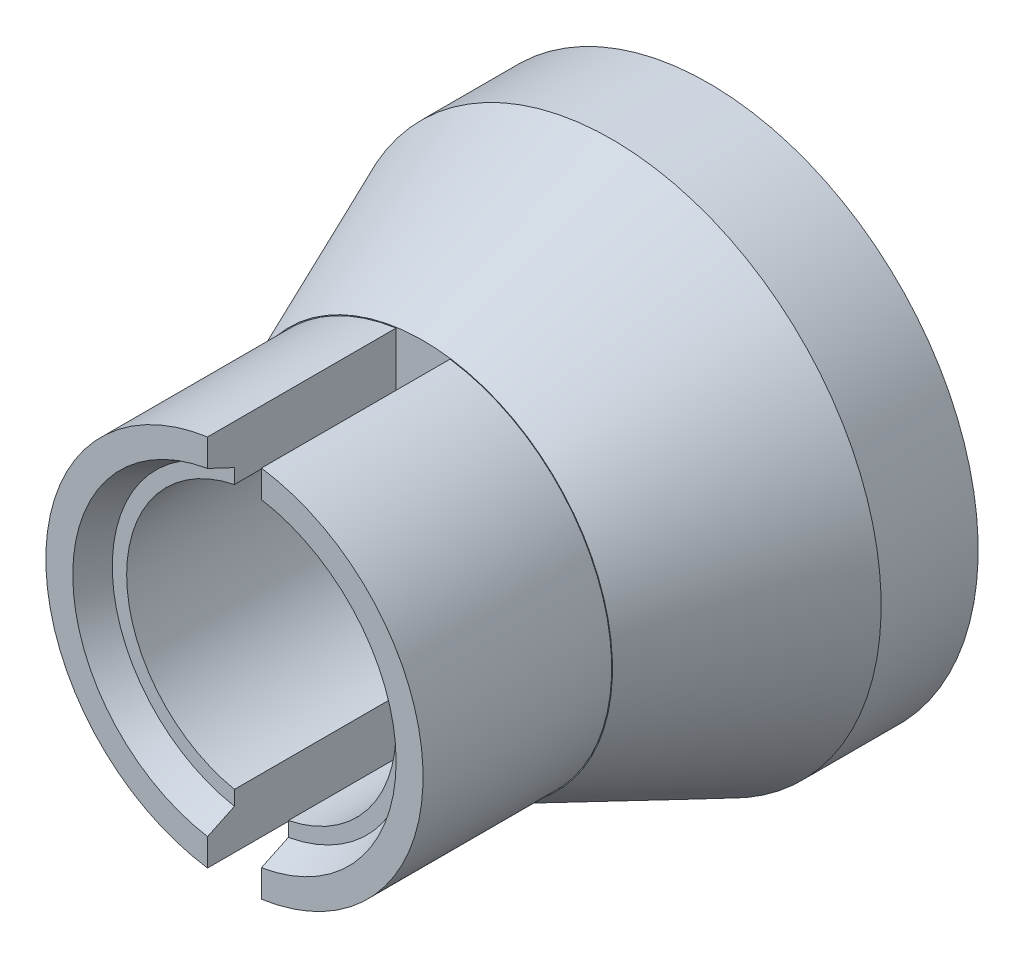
ISO-10303-21;
HEADER;
FILE_DESCRIPTION(('STEP AP214'),'2;1');
FILE_NAME('part.step','',(''),(''),'','','');
FILE_SCHEMA(('AUTOMOTIVE_DESIGN { 1 0 10303 214 1 1 1 1 }'));
ENDSEC;
DATA;
#1=APPLICATION_CONTEXT('core data for automotive mechanical design processes');
#2=APPLICATION_PROTOCOL_DEFINITION('international standard','automotive_design',2000,#1);
#3=PRODUCT_CONTEXT('',#1,'mechanical');
#4=PRODUCT('Part','Part','',(#3));
#5=PRODUCT_RELATED_PRODUCT_CATEGORY('part','',(#4));
#6=PRODUCT_DEFINITION_FORMATION('','',#4);
#7=PRODUCT_DEFINITION_CONTEXT('part definition',#1,'design');
#8=PRODUCT_DEFINITION('design','',#6,#7);
#9=PRODUCT_DEFINITION_SHAPE('','',#8);
#10=(LENGTH_UNIT() NAMED_UNIT(*) SI_UNIT(.MILLI.,.METRE.));
#11=(NAMED_UNIT(*) PLANE_ANGLE_UNIT() SI_UNIT($,.RADIAN.));
#12=(NAMED_UNIT(*) SI_UNIT($,.STERADIAN.) SOLID_ANGLE_UNIT());
#13=UNCERTAINTY_MEASURE_WITH_UNIT(LENGTH_MEASURE(1.E-05),#10,'distance_accuracy_value','');
#14=(GEOMETRIC_REPRESENTATION_CONTEXT(3) GLOBAL_UNCERTAINTY_ASSIGNED_CONTEXT((#13)) GLOBAL_UNIT_ASSIGNED_CONTEXT((#10,
#11,#12)) REPRESENTATION_CONTEXT('',''));
#15=CARTESIAN_POINT('',(0.,0.,0.));
#16=DIRECTION('',(0.,0.,1.));
#17=DIRECTION('',(1.,0.,0.));
#18=AXIS2_PLACEMENT_3D('',#15,#16,#17);
#19=CARTESIAN_POINT('',(0.,0.,0.));
#20=DIRECTION('',(0.,0.,-1.));
#21=DIRECTION('',(-1.,0.,0.));
#22=AXIS2_PLACEMENT_3D('',#19,#20,#21);
#23=PLANE('',#22);
#24=CARTESIAN_POINT('',(0.,0.,0.));
#25=DIRECTION('',(0.,0.,-1.));
#26=DIRECTION('',(-1.,0.,0.));
#27=AXIS2_PLACEMENT_3D('',#24,#25,#26);
#28=CIRCLE('',#27,3.51433814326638);
#29=CARTESIAN_POINT('',(-3.51433814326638,0.,0.));
#30=VERTEX_POINT('',#29);
#31=EDGE_CURVE('E248',#30,#30,#28,.T.);
#32=ORIENTED_EDGE('',*,*,#31,.F.);
#33=EDGE_LOOP('',(#32));
#34=FACE_BOUND('',#33,.T.);
#35=DIRECTION('',(0.,-1.,0.));
#36=VECTOR('',#35,1.);
#37=CARTESIAN_POINT('',(-0.5,0.,0.));
#38=LINE('',#37,#36);
#39=CARTESIAN_POINT('',(-0.5,3.46410161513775,0.));
#40=VERTEX_POINT('',#39);
#41=CARTESIAN_POINT('',(-0.5,2.44948974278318,0.));
#42=VERTEX_POINT('',#41);
#43=EDGE_CURVE('E119',#40,#42,#38,.T.);
#44=ORIENTED_EDGE('',*,*,#43,.T.);
#45=CARTESIAN_POINT('',(0.,0.,0.));
#46=DIRECTION('',(0.,0.,1.));
#47=DIRECTION('',(1.,0.,0.));
#48=AXIS2_PLACEMENT_3D('',#45,#46,#47);
#49=CIRCLE('',#48,2.5);
#50=CARTESIAN_POINT('',(0.5,2.44948974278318,0.));
#51=VERTEX_POINT('',#50);
#52=EDGE_CURVE('E117',#51,#42,#49,.T.);
#53=ORIENTED_EDGE('',*,*,#52,.F.);
#54=DIRECTION('',(0.,1.,0.));
#55=VECTOR('',#54,1.);
#56=CARTESIAN_POINT('',(0.5,0.,0.));
#57=LINE('',#56,#55);
#58=CARTESIAN_POINT('',(0.5,3.46410161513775,0.));
#59=VERTEX_POINT('',#58);
#60=EDGE_CURVE('E44',#51,#59,#57,.T.);
#61=ORIENTED_EDGE('',*,*,#60,.T.);
#62=CARTESIAN_POINT('',(0.,0.,0.));
#63=DIRECTION('',(0.,0.,1.));
#64=DIRECTION('',(1.,0.,0.));
#65=AXIS2_PLACEMENT_3D('',#62,#63,#64);
#66=CIRCLE('',#65,3.5);
#67=CARTESIAN_POINT('',(0.499999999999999,-3.46410161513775,0.));
#68=VERTEX_POINT('',#67);
#69=EDGE_CURVE('E312',#68,#59,#66,.T.);
#70=ORIENTED_EDGE('',*,*,#69,.F.);
#71=CARTESIAN_POINT('',(0.499999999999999,-2.44948974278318,0.));
#72=VERTEX_POINT('',#71);
#73=EDGE_CURVE('E132',#68,#72,#57,.T.);
#74=ORIENTED_EDGE('',*,*,#73,.T.);
#75=CARTESIAN_POINT('',(-0.499999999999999,-2.44948974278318,0.));
#76=VERTEX_POINT('',#75);
#77=EDGE_CURVE('E52',#76,#72,#49,.T.);
#78=ORIENTED_EDGE('',*,*,#77,.F.);
#79=CARTESIAN_POINT('',(-0.499999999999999,-3.46410161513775,0.));
#80=VERTEX_POINT('',#79);
#81=EDGE_CURVE('E288',#76,#80,#38,.T.);
#82=ORIENTED_EDGE('',*,*,#81,.T.);
#83=CARTESIAN_POINT('',(0.,0.,0.));
#84=DIRECTION('',(0.,0.,1.));
#85=DIRECTION('',(1.,0.,0.));
#86=AXIS2_PLACEMENT_3D('',#83,#84,#85);
#87=CIRCLE('',#86,3.5);
#88=EDGE_CURVE('E264',#40,#80,#87,.T.);
#89=ORIENTED_EDGE('',*,*,#88,.F.);
#90=EDGE_LOOP('',(#44,#53,#61,#70,#74,#78,#82,#89));
#91=FACE_BOUND('',#90,.T.);
#92=ADVANCED_FACE('F27',(#34,#91),#23,.F.);
#93=CARTESIAN_POINT('',(0.,0.,3.5));
#94=DIRECTION('',(0.,0.,-1.));
#95=DIRECTION('',(-1.,0.,0.));
#96=AXIS2_PLACEMENT_3D('',#93,#94,#95);
#97=CYLINDRICAL_SURFACE('',#96,2.5);
#98=DIRECTION('',(0.,0.,-1.));
#99=VECTOR('',#98,1.);
#100=CARTESIAN_POINT('',(-0.5,2.44948974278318,3.5));
#101=LINE('',#100,#99);
#102=CARTESIAN_POINT('',(-0.5,2.44948974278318,3.));
#103=VERTEX_POINT('',#102);
#104=EDGE_CURVE('E11',#103,#42,#101,.T.);
#105=ORIENTED_EDGE('',*,*,#104,.F.);
#106=CARTESIAN_POINT('',(0.,0.,3.));
#107=DIRECTION('',(0.,0.,1.));
#108=DIRECTION('',(1.,0.,0.));
#109=AXIS2_PLACEMENT_3D('',#106,#107,#108);
#110=CIRCLE('',#109,2.5);
#111=CARTESIAN_POINT('',(-0.499999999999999,-2.44948974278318,3.));
#112=VERTEX_POINT('',#111);
#113=EDGE_CURVE('E250',#103,#112,#110,.T.);
#114=ORIENTED_EDGE('',*,*,#113,.T.);
#115=DIRECTION('',(0.,0.,-1.));
#116=VECTOR('',#115,1.);
#117=CARTESIAN_POINT('',(-0.499999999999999,-2.44948974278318,3.5));
#118=LINE('',#117,#116);
#119=EDGE_CURVE('E260',#76,#112,#118,.F.);
#120=ORIENTED_EDGE('',*,*,#119,.F.);
#121=ORIENTED_EDGE('',*,*,#77,.T.);
#122=DIRECTION('',(0.,0.,-1.));
#123=VECTOR('',#122,1.);
#124=CARTESIAN_POINT('',(0.499999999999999,-2.44948974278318,3.5));
#125=LINE('',#124,#123);
#126=CARTESIAN_POINT('',(0.499999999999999,-2.44948974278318,3.));
#127=VERTEX_POINT('',#126);
#128=EDGE_CURVE('E157',#127,#72,#125,.T.);
#129=ORIENTED_EDGE('',*,*,#128,.F.);
#130=CARTESIAN_POINT('',(0.,0.,3.));
#131=DIRECTION('',(0.,0.,1.));
#132=DIRECTION('',(1.,0.,0.));
#133=AXIS2_PLACEMENT_3D('',#130,#131,#132);
#134=CIRCLE('',#133,2.5);
#135=CARTESIAN_POINT('',(0.5,2.44948974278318,3.));
#136=VERTEX_POINT('',#135);
#137=EDGE_CURVE('E137',#127,#136,#134,.T.);
#138=ORIENTED_EDGE('',*,*,#137,.T.);
#139=DIRECTION('',(0.,0.,-1.));
#140=VECTOR('',#139,1.);
#141=CARTESIAN_POINT('',(0.5,2.44948974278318,3.5));
#142=LINE('',#141,#140);
#143=EDGE_CURVE('E126',#51,#136,#142,.F.);
#144=ORIENTED_EDGE('',*,*,#143,.F.);
#145=ORIENTED_EDGE('',*,*,#52,.T.);
#146=EDGE_LOOP('',(#105,#114,#120,#121,#129,#138,#144,#145));
#147=FACE_BOUND('',#146,.T.);
#148=CARTESIAN_POINT('',(0.,0.,-1.865431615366));
#149=DIRECTION('',(0.,0.,-1.));
#150=DIRECTION('',(-1.,0.,0.));
#151=AXIS2_PLACEMENT_3D('',#148,#149,#150);
#152=CIRCLE('',#151,2.5);
#153=CARTESIAN_POINT('',(-2.5,0.,-1.865431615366));
#154=VERTEX_POINT('',#153);
#155=EDGE_CURVE('E31',#154,#154,#152,.T.);
#156=ORIENTED_EDGE('',*,*,#155,.T.);
#157=EDGE_LOOP('',(#156));
#158=FACE_BOUND('',#157,.T.);
#159=ADVANCED_FACE('F134',(#147,#158),#97,.F.);
#160=CARTESIAN_POINT('',(0.,0.,3.5));
#161=DIRECTION('',(0.,0.,1.));
#162=DIRECTION('',(1.,0.,0.));
#163=AXIS2_PLACEMENT_3D('',#160,#161,#162);
#164=PLANE('',#163);
#165=DIRECTION('',(0.,-1.,0.));
#166=VECTOR('',#165,1.);
#167=CARTESIAN_POINT('',(-0.5,3.68551304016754,3.5));
#168=LINE('',#167,#166);
#169=CARTESIAN_POINT('',(-0.5,3.46410161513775,3.5));
#170=VERTEX_POINT('',#169);
#171=CARTESIAN_POINT('',(-0.5,2.95803989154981,3.5));
#172=VERTEX_POINT('',#171);
#173=EDGE_CURVE('E270',#170,#172,#168,.T.);
#174=ORIENTED_EDGE('',*,*,#173,.F.);
#175=CARTESIAN_POINT('',(0.,0.,3.5));
#176=DIRECTION('',(0.,0.,1.));
#177=DIRECTION('',(1.,0.,0.));
#178=AXIS2_PLACEMENT_3D('',#175,#176,#177);
#179=CIRCLE('',#178,3.5);
#180=CARTESIAN_POINT('',(-0.499999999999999,-3.46410161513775,3.5));
#181=VERTEX_POINT('',#180);
#182=EDGE_CURVE('E263',#170,#181,#179,.T.);
#183=ORIENTED_EDGE('',*,*,#182,.T.);
#184=CARTESIAN_POINT('',(-0.499999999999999,-2.95803989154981,3.5));
#185=VERTEX_POINT('',#184);
#186=EDGE_CURVE('E269',#185,#181,#168,.T.);
#187=ORIENTED_EDGE('',*,*,#186,.F.);
#188=CARTESIAN_POINT('',(0.,0.,3.5));
#189=DIRECTION('',(0.,0.,1.));
#190=DIRECTION('',(1.,0.,0.));
#191=AXIS2_PLACEMENT_3D('',#188,#189,#190);
#192=CIRCLE('',#191,3.);
#193=EDGE_CURVE('E255',#172,#185,#192,.T.);
#194=ORIENTED_EDGE('',*,*,#193,.F.);
#195=EDGE_LOOP('',(#174,#183,#187,#194));
#196=FACE_BOUND('',#195,.T.);
#197=ADVANCED_FACE('F195',(#196),#164,.T.);
#198=CARTESIAN_POINT('',(0.,0.,3.5));
#199=DIRECTION('',(0.,0.,-1.));
#200=DIRECTION('',(-1.,0.,0.));
#201=AXIS2_PLACEMENT_3D('',#198,#199,#200);
#202=CYLINDRICAL_SURFACE('',#201,3.5);
#203=ORIENTED_EDGE('',*,*,#182,.F.);
#204=DIRECTION('',(0.,0.,-1.));
#205=VECTOR('',#204,1.);
#206=CARTESIAN_POINT('',(-0.5,3.46410161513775,3.5));
#207=LINE('',#206,#205);
#208=EDGE_CURVE('E267',#170,#40,#207,.T.);
#209=ORIENTED_EDGE('',*,*,#208,.T.);
#210=ORIENTED_EDGE('',*,*,#88,.T.);
#211=DIRECTION('',(0.,0.,-1.));
#212=VECTOR('',#211,1.);
#213=CARTESIAN_POINT('',(-0.499999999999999,-3.46410161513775,3.5));
#214=LINE('',#213,#212);
#215=EDGE_CURVE('E224',#80,#181,#214,.F.);
#216=ORIENTED_EDGE('',*,*,#215,.T.);
#217=EDGE_LOOP('',(#203,#209,#210,#216));
#218=FACE_BOUND('',#217,.T.);
#219=ADVANCED_FACE('F230',(#218),#202,.T.);
#220=CARTESIAN_POINT('',(0.,0.,3.5));
#221=DIRECTION('',(0.,0.,1.));
#222=DIRECTION('',(1.,0.,0.));
#223=AXIS2_PLACEMENT_3D('',#220,#221,#222);
#224=CONICAL_SURFACE('',#223,3.,0.436332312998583);
#225=ORIENTED_EDGE('',*,*,#193,.T.);
#226=CARTESIAN_POINT('',(-0.499999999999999,-4.39444655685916,6.55120461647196));
#227=CARTESIAN_POINT('',(-0.499999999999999,-4.25625075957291,6.25675357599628));
#228=CARTESIAN_POINT('',(-0.499999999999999,-4.11799461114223,5.96233081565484));
#229=CARTESIAN_POINT('',(-0.499999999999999,-3.84129760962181,5.37357461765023));
#230=CARTESIAN_POINT('',(-0.499999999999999,-3.70285675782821,5.07924117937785));
#231=CARTESIAN_POINT('',(-0.499999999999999,-3.42572981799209,4.49070374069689));
#232=CARTESIAN_POINT('',(-0.499999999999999,-3.2870437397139,4.19649973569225));
#233=CARTESIAN_POINT('',(-0.499999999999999,-3.00930612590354,3.6082616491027));
#234=CARTESIAN_POINT('',(-0.499999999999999,-2.87025458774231,3.31422756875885));
#235=CARTESIAN_POINT('',(-0.499999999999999,-2.59159322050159,2.72640012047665));
#236=CARTESIAN_POINT('',(-0.499999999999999,-2.45198335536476,2.43260676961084));
#237=CARTESIAN_POINT('',(-0.499999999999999,-2.24188882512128,1.99224424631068));
#238=CARTESIAN_POINT('',(-0.499999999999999,-2.17174467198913,1.84551266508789));
#239=CARTESIAN_POINT('',(-0.499999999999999,-2.03115092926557,1.5521950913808));
#240=CARTESIAN_POINT('',(-0.499999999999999,-1.96070133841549,1.40560909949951));
#241=CARTESIAN_POINT('',(-0.499999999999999,-1.8193825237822,1.11262756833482));
#242=CARTESIAN_POINT('',(-0.499999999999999,-1.74851327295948,0.966232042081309));
#243=CARTESIAN_POINT('',(-0.499999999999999,-1.60618643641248,0.673729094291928));
#244=CARTESIAN_POINT('',(-0.499999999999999,-1.53472885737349,0.527621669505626));
#245=CARTESIAN_POINT('',(-0.499999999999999,-1.39093746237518,0.235826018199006));
#246=CARTESIAN_POINT('',(-0.499999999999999,-1.31860359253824,0.0901378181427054));
#247=CARTESIAN_POINT('',(-0.499999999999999,-1.20905736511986,-0.127873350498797));
#248=CARTESIAN_POINT('',(-0.499999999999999,-1.17236700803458,-0.200458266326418));
#249=CARTESIAN_POINT('',(-0.499999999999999,-1.09851706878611,-0.345390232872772));
#250=CARTESIAN_POINT('',(-0.499999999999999,-1.06135747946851,-0.417737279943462));
#251=CARTESIAN_POINT('',(-0.499999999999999,-1.02390323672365,-0.489932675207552));
#252=B_SPLINE_CURVE_WITH_KNOTS('',3,(#226,#227,#228,#229,#230,#231,#232,#233,#234,#235,#236,
#237,#238,#239,#240,#241,#242,#243,#244,#245,#246,#247,#248,#249,#250,#251),.UNSPECIFIED.,.F.,
.F.,(4,2,2,2,2,2,2,2,2,2,2,2,4),(0.,0.975805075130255,1.95160333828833,2.92736358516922,
3.9031308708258,4.87896222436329,5.36686896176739,5.85477771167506,6.34271824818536,
6.83065324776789,7.31861840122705,7.56261029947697,7.80660592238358),.UNSPECIFIED.);
#253=CARTESIAN_POINT('',(-0.499999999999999,-2.72129339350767,3.));
#254=VERTEX_POINT('',#253);
#255=EDGE_CURVE('E209',#185,#254,#252,.T.);
#256=ORIENTED_EDGE('',*,*,#255,.T.);
#257=CARTESIAN_POINT('',(0.,0.,3.));
#258=DIRECTION('',(0.,0.,1.));
#259=DIRECTION('',(1.,0.,0.));
#260=AXIS2_PLACEMENT_3D('',#257,#258,#259);
#261=CIRCLE('',#260,2.7668461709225);
#262=CARTESIAN_POINT('',(-0.5,2.72129339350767,3.));
#263=VERTEX_POINT('',#262);
#264=EDGE_CURVE('E222',#263,#254,#261,.T.);
#265=ORIENTED_EDGE('',*,*,#264,.F.);
#266=CARTESIAN_POINT('',(-0.5,1.02390323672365,-0.489932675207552));
#267=CARTESIAN_POINT('',(-0.5,1.05465071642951,-0.430671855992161));
#268=CARTESIAN_POINT('',(-0.5,1.08519633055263,-0.371306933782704));
#269=CARTESIAN_POINT('',(-0.5,1.1459559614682,-0.252408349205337));
#270=CARTESIAN_POINT('',(-0.5,1.17616998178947,-0.192874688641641));
#271=CARTESIAN_POINT('',(-0.5,1.26642192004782,-0.0140816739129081));
#272=CARTESIAN_POINT('',(-0.5,1.32607165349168,0.10537347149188));
#273=CARTESIAN_POINT('',(-0.5,1.4446751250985,0.344618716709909));
#274=CARTESIAN_POINT('',(-0.5,1.50362890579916,0.464408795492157));
#275=CARTESIAN_POINT('',(-0.5,1.62104619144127,0.70423027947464));
#276=CARTESIAN_POINT('',(-0.5,1.67950969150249,0.824261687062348));
#277=CARTESIAN_POINT('',(-0.5,1.82151143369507,1.11691037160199));
#278=CARTESIAN_POINT('',(-0.5,1.90485971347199,1.28961975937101));
#279=CARTESIAN_POINT('',(-0.5,2.07105982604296,1.63527733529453));
#280=CARTESIAN_POINT('',(-0.5,2.15391165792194,1.80822552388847));
#281=CARTESIAN_POINT('',(-0.5,2.40195639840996,2.32733245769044));
#282=CARTESIAN_POINT('',(-0.5,2.5666313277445,2.67373860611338));
#283=CARTESIAN_POINT('',(-0.5,2.87026211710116,3.31424784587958));
#284=CARTESIAN_POINT('',(-0.5,3.00932405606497,3.60830074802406));
#285=CARTESIAN_POINT('',(-0.5,3.28708190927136,4.19657945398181));
#286=CARTESIAN_POINT('',(-0.5,3.42577782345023,4.49080525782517));
#287=CARTESIAN_POINT('',(-0.5,3.7029054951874,5.07934511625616));
#288=CARTESIAN_POINT('',(-0.5,3.84133727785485,5.37365915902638));
#289=CARTESIAN_POINT('',(-0.5,4.11801507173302,5.9623742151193));
#290=CARTESIAN_POINT('',(-0.5,4.25626108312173,6.25677522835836));
#291=CARTESIAN_POINT('',(-0.5,4.39444655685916,6.55120461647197));
#292=B_SPLINE_CURVE_WITH_KNOTS('',3,(#266,#267,#268,#269,#270,#271,#272,#273,#274,#275,#276,
#277,#278,#279,#280,#281,#282,#283,#284,#285,#286,#287,#288,#289,#290,#291),.UNSPECIFIED.,.F.,
.F.,(4,2,2,2,2,2,2,2,2,2,2,2,4),(0.,0.200286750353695,0.400571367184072,0.801127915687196,
1.20165985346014,1.60219577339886,2.17750242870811,2.75281014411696,3.9034754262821,
4.8793072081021,5.85513915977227,6.83087319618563,7.80660629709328),.UNSPECIFIED.);
#293=EDGE_CURVE('E216',#263,#172,#292,.T.);
#294=ORIENTED_EDGE('',*,*,#293,.T.);
#295=EDGE_LOOP('',(#225,#256,#265,#294));
#296=FACE_BOUND('',#295,.T.);
#297=ADVANCED_FACE('F226',(#296),#224,.F.);
#298=CARTESIAN_POINT('',(0.,0.,3.));
#299=DIRECTION('',(0.,0.,1.));
#300=DIRECTION('',(1.,0.,0.));
#301=AXIS2_PLACEMENT_3D('',#298,#299,#300);
#302=PLANE('',#301);
#303=DIRECTION('',(0.,-1.,0.));
#304=VECTOR('',#303,1.);
#305=CARTESIAN_POINT('',(-0.5,0.,3.));
#306=LINE('',#305,#304);
#307=EDGE_CURVE('E36',#263,#103,#306,.T.);
#308=ORIENTED_EDGE('',*,*,#307,.F.);
#309=ORIENTED_EDGE('',*,*,#264,.T.);
#310=EDGE_CURVE('E271',#112,#254,#306,.T.);
#311=ORIENTED_EDGE('',*,*,#310,.F.);
#312=ORIENTED_EDGE('',*,*,#113,.F.);
#313=EDGE_LOOP('',(#308,#309,#311,#312));
#314=FACE_BOUND('',#313,.T.);
#315=ADVANCED_FACE('F205',(#314),#302,.T.);
#316=CARTESIAN_POINT('',(-0.5,3.68551304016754,-0.5));
#317=DIRECTION('',(-1.,0.,0.));
#318=DIRECTION('',(0.,-1.,0.));
#319=AXIS2_PLACEMENT_3D('',#316,#317,#318);
#320=PLANE('',#319);
#321=ORIENTED_EDGE('',*,*,#81,.F.);
#322=ORIENTED_EDGE('',*,*,#119,.T.);
#323=ORIENTED_EDGE('',*,*,#310,.T.);
#324=ORIENTED_EDGE('',*,*,#255,.F.);
#325=ORIENTED_EDGE('',*,*,#186,.T.);
#326=ORIENTED_EDGE('',*,*,#215,.F.);
#327=EDGE_LOOP('',(#321,#322,#323,#324,#325,#326));
#328=FACE_BOUND('',#327,.T.);
#329=ADVANCED_FACE('F203',(#328),#320,.F.);
#330=ORIENTED_EDGE('',*,*,#173,.T.);
#331=ORIENTED_EDGE('',*,*,#293,.F.);
#332=ORIENTED_EDGE('',*,*,#307,.T.);
#333=ORIENTED_EDGE('',*,*,#104,.T.);
#334=ORIENTED_EDGE('',*,*,#43,.F.);
#335=ORIENTED_EDGE('',*,*,#208,.F.);
#336=EDGE_LOOP('',(#330,#331,#332,#333,#334,#335));
#337=FACE_BOUND('',#336,.T.);
#338=ADVANCED_FACE('F199',(#337),#320,.F.);
#339=CARTESIAN_POINT('',(0.,0.,-3.5));
#340=DIRECTION('',(0.,0.,-1.));
#341=DIRECTION('',(-1.,0.,0.));
#342=AXIS2_PLACEMENT_3D('',#339,#340,#341);
#343=CONICAL_SURFACE('',#342,5.,0.401425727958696);
#344=CARTESIAN_POINT('',(0.,0.,-3.5));
#345=DIRECTION('',(0.,0.,-1.));
#346=DIRECTION('',(-1.,0.,0.));
#347=AXIS2_PLACEMENT_3D('',#344,#345,#346);
#348=CIRCLE('',#347,5.);
#349=CARTESIAN_POINT('',(-5.,0.,-3.5));
#350=VERTEX_POINT('',#349);
#351=EDGE_CURVE('E246',#350,#350,#348,.T.);
#352=ORIENTED_EDGE('',*,*,#351,.F.);
#353=EDGE_LOOP('',(#352));
#354=FACE_BOUND('',#353,.T.);
#355=ORIENTED_EDGE('',*,*,#31,.T.);
#356=EDGE_LOOP('',(#355));
#357=FACE_BOUND('',#356,.T.);
#358=ADVANCED_FACE('F175',(#354,#357),#343,.T.);
#359=CARTESIAN_POINT('',(0.,0.,3.));
#360=DIRECTION('',(0.,0.,1.));
#361=DIRECTION('',(1.,0.,0.));
#362=AXIS2_PLACEMENT_3D('',#359,#360,#361);
#363=PLANE('',#362);
#364=DIRECTION('',(0.,1.,0.));
#365=VECTOR('',#364,1.);
#366=CARTESIAN_POINT('',(0.5,0.,3.));
#367=LINE('',#366,#365);
#368=CARTESIAN_POINT('',(0.499999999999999,-2.72129339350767,3.));
#369=VERTEX_POINT('',#368);
#370=EDGE_CURVE('E249',#369,#127,#367,.T.);
#371=ORIENTED_EDGE('',*,*,#370,.F.);
#372=CARTESIAN_POINT('',(0.,0.,3.));
#373=DIRECTION('',(0.,0.,1.));
#374=DIRECTION('',(1.,0.,0.));
#375=AXIS2_PLACEMENT_3D('',#372,#373,#374);
#376=CIRCLE('',#375,2.7668461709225);
#377=CARTESIAN_POINT('',(0.5,2.72129339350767,3.));
#378=VERTEX_POINT('',#377);
#379=EDGE_CURVE('E308',#369,#378,#376,.T.);
#380=ORIENTED_EDGE('',*,*,#379,.T.);
#381=EDGE_CURVE('E252',#136,#378,#367,.T.);
#382=ORIENTED_EDGE('',*,*,#381,.F.);
#383=ORIENTED_EDGE('',*,*,#137,.F.);
#384=EDGE_LOOP('',(#371,#380,#382,#383));
#385=FACE_BOUND('',#384,.T.);
#386=ADVANCED_FACE('F171',(#385),#363,.T.);
#387=CARTESIAN_POINT('',(0.,0.,3.5));
#388=DIRECTION('',(0.,0.,1.));
#389=DIRECTION('',(1.,0.,0.));
#390=AXIS2_PLACEMENT_3D('',#387,#388,#389);
#391=CONICAL_SURFACE('',#390,3.,0.436332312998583);
#392=ORIENTED_EDGE('',*,*,#379,.F.);
#393=CARTESIAN_POINT('',(0.499999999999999,-1.02390323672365,-0.489932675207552));
#394=CARTESIAN_POINT('',(0.499999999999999,-1.05465071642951,-0.430671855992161));
#395=CARTESIAN_POINT('',(0.499999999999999,-1.08519633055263,-0.371306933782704));
#396=CARTESIAN_POINT('',(0.499999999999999,-1.1459559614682,-0.252408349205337));
#397=CARTESIAN_POINT('',(0.499999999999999,-1.17616998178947,-0.192874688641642));
#398=CARTESIAN_POINT('',(0.499999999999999,-1.26642192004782,-0.0140816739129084));
#399=CARTESIAN_POINT('',(0.499999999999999,-1.32607165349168,0.105373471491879));
#400=CARTESIAN_POINT('',(0.499999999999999,-1.4446751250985,0.344618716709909));
#401=CARTESIAN_POINT('',(0.499999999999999,-1.50362890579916,0.464408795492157));
#402=CARTESIAN_POINT('',(0.499999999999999,-1.62104619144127,0.70423027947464));
#403=CARTESIAN_POINT('',(0.499999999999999,-1.67950969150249,0.824261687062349));
#404=CARTESIAN_POINT('',(0.499999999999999,-1.82151143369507,1.11691037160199));
#405=CARTESIAN_POINT('',(0.499999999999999,-1.90485971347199,1.28961975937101));
#406=CARTESIAN_POINT('',(0.499999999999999,-2.07105982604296,1.63527733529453));
#407=CARTESIAN_POINT('',(0.499999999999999,-2.15391165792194,1.80822552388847));
#408=CARTESIAN_POINT('',(0.499999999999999,-2.40195639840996,2.32733245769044));
#409=CARTESIAN_POINT('',(0.499999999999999,-2.5666313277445,2.67373860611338));
#410=CARTESIAN_POINT('',(0.499999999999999,-2.87026211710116,3.31424784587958));
#411=CARTESIAN_POINT('',(0.499999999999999,-3.00932405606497,3.60830074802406));
#412=CARTESIAN_POINT('',(0.499999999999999,-3.28708190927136,4.19657945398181));
#413=CARTESIAN_POINT('',(0.499999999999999,-3.42577782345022,4.49080525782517));
#414=CARTESIAN_POINT('',(0.499999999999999,-3.7029054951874,5.07934511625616));
#415=CARTESIAN_POINT('',(0.499999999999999,-3.84133727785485,5.37365915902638));
#416=CARTESIAN_POINT('',(0.499999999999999,-4.11801507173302,5.9623742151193));
#417=CARTESIAN_POINT('',(0.499999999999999,-4.25626108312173,6.25677522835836));
#418=CARTESIAN_POINT('',(0.499999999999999,-4.39444655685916,6.55120461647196));
#419=B_SPLINE_CURVE_WITH_KNOTS('',3,(#393,#394,#395,#396,#397,#398,#399,#400,#401,#402,#403,
#404,#405,#406,#407,#408,#409,#410,#411,#412,#413,#414,#415,#416,#417,#418),.UNSPECIFIED.,.F.,
.F.,(4,2,2,2,2,2,2,2,2,2,2,2,4),(0.,0.200286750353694,0.400571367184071,0.801127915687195,
1.20165985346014,1.60219577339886,2.17750242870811,2.75281014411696,3.9034754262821,
4.8793072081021,5.85513915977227,6.83087319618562,7.80660629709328),.UNSPECIFIED.);
#420=CARTESIAN_POINT('',(0.499999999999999,-2.95803989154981,3.5));
#421=VERTEX_POINT('',#420);
#422=EDGE_CURVE('E151',#369,#421,#419,.T.);
#423=ORIENTED_EDGE('',*,*,#422,.T.);
#424=CARTESIAN_POINT('',(0.,0.,3.5));
#425=DIRECTION('',(0.,0.,1.));
#426=DIRECTION('',(1.,0.,0.));
#427=AXIS2_PLACEMENT_3D('',#424,#425,#426);
#428=CIRCLE('',#427,3.);
#429=CARTESIAN_POINT('',(0.5,2.95803989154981,3.5));
#430=VERTEX_POINT('',#429);
#431=EDGE_CURVE('E306',#421,#430,#428,.T.);
#432=ORIENTED_EDGE('',*,*,#431,.T.);
#433=CARTESIAN_POINT('',(0.5,4.39444655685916,6.55120461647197));
#434=CARTESIAN_POINT('',(0.5,4.25625075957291,6.25675357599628));
#435=CARTESIAN_POINT('',(0.5,4.11799461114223,5.96233081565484));
#436=CARTESIAN_POINT('',(0.5,3.84129760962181,5.37357461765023));
#437=CARTESIAN_POINT('',(0.5,3.70285675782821,5.07924117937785));
#438=CARTESIAN_POINT('',(0.5,3.42572981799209,4.49070374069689));
#439=CARTESIAN_POINT('',(0.5,3.2870437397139,4.19649973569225));
#440=CARTESIAN_POINT('',(0.5,3.00930612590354,3.6082616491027));
#441=CARTESIAN_POINT('',(0.5,2.87025458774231,3.31422756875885));
#442=CARTESIAN_POINT('',(0.5,2.59159322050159,2.72640012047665));
#443=CARTESIAN_POINT('',(0.5,2.45198335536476,2.43260676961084));
#444=CARTESIAN_POINT('',(0.5,2.24188882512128,1.99224424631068));
#445=CARTESIAN_POINT('',(0.5,2.17174467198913,1.84551266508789));
#446=CARTESIAN_POINT('',(0.5,2.03115092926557,1.5521950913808));
#447=CARTESIAN_POINT('',(0.5,1.96070133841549,1.40560909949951));
#448=CARTESIAN_POINT('',(0.5,1.8193825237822,1.11262756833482));
#449=CARTESIAN_POINT('',(0.5,1.74851327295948,0.96623204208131));
#450=CARTESIAN_POINT('',(0.5,1.60618643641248,0.673729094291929));
#451=CARTESIAN_POINT('',(0.5,1.53472885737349,0.527621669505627));
#452=CARTESIAN_POINT('',(0.5,1.39093746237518,0.235826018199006));
#453=CARTESIAN_POINT('',(0.5,1.31860359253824,0.0901378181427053));
#454=CARTESIAN_POINT('',(0.5,1.20905736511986,-0.127873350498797));
#455=CARTESIAN_POINT('',(0.5,1.17236700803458,-0.200458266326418));
#456=CARTESIAN_POINT('',(0.5,1.09851706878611,-0.345390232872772));
#457=CARTESIAN_POINT('',(0.5,1.06135747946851,-0.417737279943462));
#458=CARTESIAN_POINT('',(0.5,1.02390323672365,-0.489932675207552));
#459=B_SPLINE_CURVE_WITH_KNOTS('',3,(#433,#434,#435,#436,#437,#438,#439,#440,#441,#442,#443,
#444,#445,#446,#447,#448,#449,#450,#451,#452,#453,#454,#455,#456,#457,#458),.UNSPECIFIED.,.F.,
.F.,(4,2,2,2,2,2,2,2,2,2,2,2,4),(0.,0.975805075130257,1.95160333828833,2.92736358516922,
3.9031308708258,4.87896222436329,5.36686896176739,5.85477771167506,6.34271824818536,
6.8306532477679,7.31861840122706,7.56261029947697,7.80660592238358),.UNSPECIFIED.);
#460=EDGE_CURVE('E138',#430,#378,#459,.T.);
#461=ORIENTED_EDGE('',*,*,#460,.T.);
#462=EDGE_LOOP('',(#392,#423,#432,#461));
#463=FACE_BOUND('',#462,.T.);
#464=ADVANCED_FACE('F159',(#463),#391,.F.);
#465=CARTESIAN_POINT('',(0.,0.,3.5));
#466=DIRECTION('',(0.,0.,-1.));
#467=DIRECTION('',(-1.,0.,0.));
#468=AXIS2_PLACEMENT_3D('',#465,#466,#467);
#469=CYLINDRICAL_SURFACE('',#468,3.5);
#470=CARTESIAN_POINT('',(0.,0.,3.5));
#471=DIRECTION('',(0.,0.,1.));
#472=DIRECTION('',(1.,0.,0.));
#473=AXIS2_PLACEMENT_3D('',#470,#471,#472);
#474=CIRCLE('',#473,3.5);
#475=CARTESIAN_POINT('',(0.499999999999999,-3.46410161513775,3.5));
#476=VERTEX_POINT('',#475);
#477=CARTESIAN_POINT('',(0.5,3.46410161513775,3.5));
#478=VERTEX_POINT('',#477);
#479=EDGE_CURVE('E314',#476,#478,#474,.T.);
#480=ORIENTED_EDGE('',*,*,#479,.F.);
#481=DIRECTION('',(0.,0.,-1.));
#482=VECTOR('',#481,1.);
#483=CARTESIAN_POINT('',(0.499999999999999,-3.46410161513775,3.5));
#484=LINE('',#483,#482);
#485=EDGE_CURVE('E301',#476,#68,#484,.T.);
#486=ORIENTED_EDGE('',*,*,#485,.T.);
#487=ORIENTED_EDGE('',*,*,#69,.T.);
#488=DIRECTION('',(0.,0.,-1.));
#489=VECTOR('',#488,1.);
#490=CARTESIAN_POINT('',(0.5,3.46410161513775,3.5));
#491=LINE('',#490,#489);
#492=EDGE_CURVE('E129',#59,#478,#491,.F.);
#493=ORIENTED_EDGE('',*,*,#492,.T.);
#494=EDGE_LOOP('',(#480,#486,#487,#493));
#495=FACE_BOUND('',#494,.T.);
#496=ADVANCED_FACE('F179',(#495),#469,.T.);
#497=CARTESIAN_POINT('',(0.,0.,3.5));
#498=DIRECTION('',(0.,0.,1.));
#499=DIRECTION('',(1.,0.,0.));
#500=AXIS2_PLACEMENT_3D('',#497,#498,#499);
#501=PLANE('',#500);
#502=DIRECTION('',(0.,1.,0.));
#503=VECTOR('',#502,1.);
#504=CARTESIAN_POINT('',(0.5,3.68551304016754,3.5));
#505=LINE('',#504,#503);
#506=EDGE_CURVE('E141',#476,#421,#505,.T.);
#507=ORIENTED_EDGE('',*,*,#506,.F.);
#508=ORIENTED_EDGE('',*,*,#479,.T.);
#509=EDGE_CURVE('E296',#430,#478,#505,.T.);
#510=ORIENTED_EDGE('',*,*,#509,.F.);
#511=ORIENTED_EDGE('',*,*,#431,.F.);
#512=EDGE_LOOP('',(#507,#508,#510,#511));
#513=FACE_BOUND('',#512,.T.);
#514=ADVANCED_FACE('F177',(#513),#501,.T.);
#515=CARTESIAN_POINT('',(0.5,3.68551304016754,-0.5));
#516=DIRECTION('',(1.,0.,0.));
#517=DIRECTION('',(0.,1.,0.));
#518=AXIS2_PLACEMENT_3D('',#515,#516,#517);
#519=PLANE('',#518);
#520=ORIENTED_EDGE('',*,*,#60,.F.);
#521=ORIENTED_EDGE('',*,*,#143,.T.);
#522=ORIENTED_EDGE('',*,*,#381,.T.);
#523=ORIENTED_EDGE('',*,*,#460,.F.);
#524=ORIENTED_EDGE('',*,*,#509,.T.);
#525=ORIENTED_EDGE('',*,*,#492,.F.);
#526=EDGE_LOOP('',(#520,#521,#522,#523,#524,#525));
#527=FACE_BOUND('',#526,.T.);
#528=ADVANCED_FACE('F125',(#527),#519,.F.);
#529=ORIENTED_EDGE('',*,*,#506,.T.);
#530=ORIENTED_EDGE('',*,*,#422,.F.);
#531=ORIENTED_EDGE('',*,*,#370,.T.);
#532=ORIENTED_EDGE('',*,*,#128,.T.);
#533=ORIENTED_EDGE('',*,*,#73,.F.);
#534=ORIENTED_EDGE('',*,*,#485,.F.);
#535=EDGE_LOOP('',(#529,#530,#531,#532,#533,#534));
#536=FACE_BOUND('',#535,.T.);
#537=ADVANCED_FACE('F163',(#536),#519,.F.);
#538=CARTESIAN_POINT('',(0.,0.,-5.3));
#539=DIRECTION('',(0.,0.,1.));
#540=DIRECTION('',(1.,0.,0.));
#541=AXIS2_PLACEMENT_3D('',#538,#539,#540);
#542=CYLINDRICAL_SURFACE('',#541,5.);
#543=CARTESIAN_POINT('',(0.,0.,-5.3));
#544=DIRECTION('',(0.,0.,-1.));
#545=DIRECTION('',(-1.,0.,0.));
#546=AXIS2_PLACEMENT_3D('',#543,#544,#545);
#547=CIRCLE('',#546,5.);
#548=CARTESIAN_POINT('',(-5.,0.,-5.3));
#549=VERTEX_POINT('',#548);
#550=EDGE_CURVE('E294',#549,#549,#547,.T.);
#551=ORIENTED_EDGE('',*,*,#550,.F.);
#552=EDGE_LOOP('',(#551));
#553=FACE_BOUND('',#552,.T.);
#554=ORIENTED_EDGE('',*,*,#351,.T.);
#555=EDGE_LOOP('',(#554));
#556=FACE_BOUND('',#555,.T.);
#557=ADVANCED_FACE('F168',(#553,#556),#542,.T.);
#558=CARTESIAN_POINT('',(0.,0.,-5.3));
#559=DIRECTION('',(0.,0.,-1.));
#560=DIRECTION('',(-1.,0.,0.));
#561=AXIS2_PLACEMENT_3D('',#558,#559,#560);
#562=PLANE('',#561);
#563=CARTESIAN_POINT('',(0.,0.,-5.3));
#564=DIRECTION('',(0.,0.,-1.));
#565=DIRECTION('',(-1.,0.,0.));
#566=AXIS2_PLACEMENT_3D('',#563,#564,#565);
#567=CIRCLE('',#566,4.25);
#568=CARTESIAN_POINT('',(-4.25,0.,-5.3));
#569=VERTEX_POINT('',#568);
#570=EDGE_CURVE('E122',#569,#569,#567,.T.);
#571=ORIENTED_EDGE('',*,*,#570,.F.);
#572=EDGE_LOOP('',(#571));
#573=FACE_BOUND('',#572,.T.);
#574=ORIENTED_EDGE('',*,*,#550,.T.);
#575=EDGE_LOOP('',(#574));
#576=FACE_BOUND('',#575,.T.);
#577=ADVANCED_FACE('F323',(#573,#576),#562,.T.);
#578=CARTESIAN_POINT('',(0.,0.,-5.3));
#579=DIRECTION('',(0.,0.,-1.));
#580=DIRECTION('',(-1.,0.,0.));
#581=AXIS2_PLACEMENT_3D('',#578,#579,#580);
#582=CONICAL_SURFACE('',#581,4.25,0.47123889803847);
#583=ORIENTED_EDGE('',*,*,#155,.F.);
#584=EDGE_LOOP('',(#583));
#585=FACE_BOUND('',#584,.T.);
#586=ORIENTED_EDGE('',*,*,#570,.T.);
#587=EDGE_LOOP('',(#586));
#588=FACE_BOUND('',#587,.T.);
#589=ADVANCED_FACE('F29',(#585,#588),#582,.F.);
#590=CLOSED_SHELL('',(#92,#159,#197,#219,#297,#315,#329,#338,#358,#386,#464,#496,#514,#528,#537,
#557,#577,#589));
#591=MANIFOLD_SOLID_BREP('B2',#590);
#592=ADVANCED_BREP_SHAPE_REPRESENTATION('',(#18,#591),#14);
#593=SHAPE_DEFINITION_REPRESENTATION(#9,#592);
ENDSEC;
END-ISO-10303-21;
